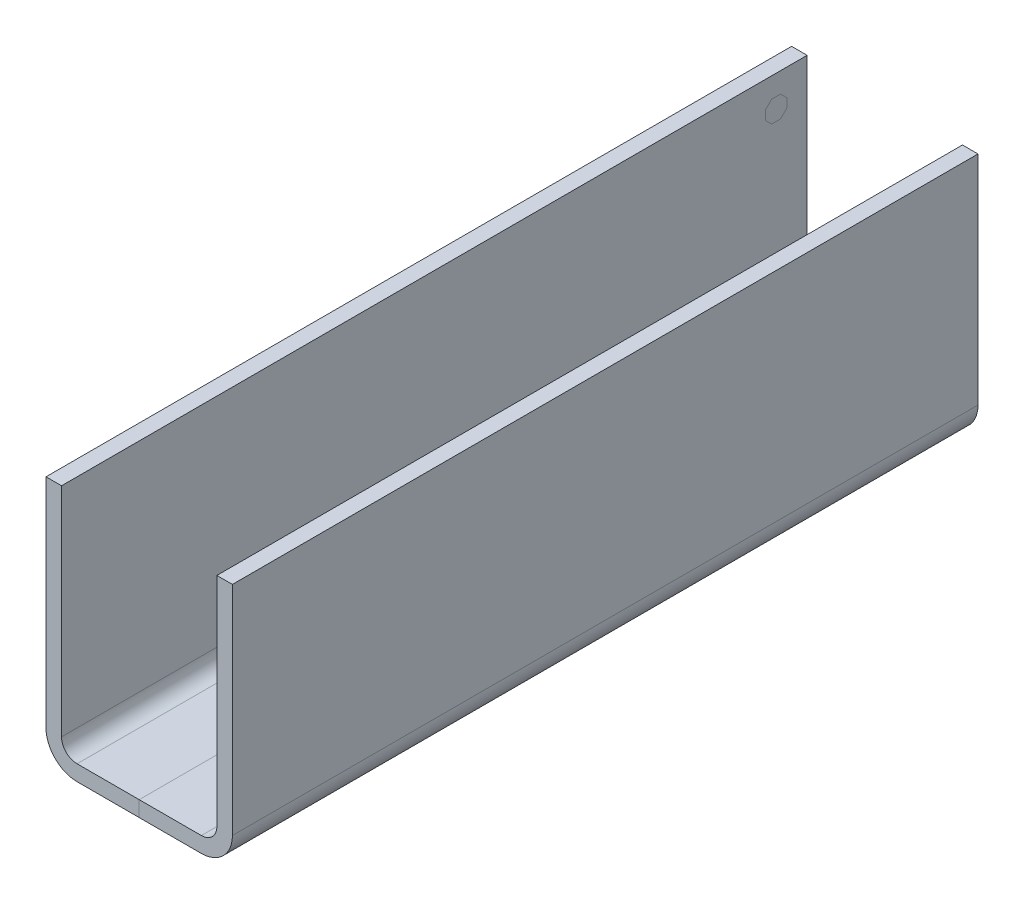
from build123d import *

# Parameters (mm, degrees)
EXTRUDE_THIN1_DEPTH    = 304.8
SPLIT1_SURFACE_1_BACK  = 661.4
SPLIT1_SURFACE_1_DEPTH = 1322.8
SPLIT1_SURFACE_2_BACK  = 661.4
SPLIT1_SURFACE_2_DEPTH = 1322.8


with BuildPart() as part:
    # Sketch1 → Extrude-Thin1 (new, symmetric)
    with BuildSketch(Plane.XY):
        with BuildLine():
            Line((-76.2, 203.2), (-76.2, 25.4))
            ThreePointArc((-76.2, 25.4), (-68.760512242, 7.439487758), (-50.8, 0))
            Line((-50.8, 0), (50.8, 0))
            ThreePointArc((50.8, 0), (68.760512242, 7.439487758), (76.2, 25.4))
            Line((76.2, 25.4), (76.2, 203.2))
            Line((76.2, 203.2), (63.5, 203.2))
            Line((63.5, 203.2), (63.5, 25.4))
            ThreePointArc((63.5, 25.4), (59.780256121, 16.419743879), (50.8, 12.7))
            Line((50.8, 12.7), (-50.8, 12.7))
            ThreePointArc((-50.8, 12.7), (-59.780256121, 16.419743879), (-63.5, 25.4))
            Line((-63.5, 25.4), (-63.5, 203.2))
            Line((-63.5, 203.2), (-76.2, 203.2))
        make_face()
    extrude(amount=EXTRUDE_THIN1_DEPTH, both=True)


with BuildPart() as body_2:
    # Split1: the piece behind the surface
    add(part.part)
    # Split1 surface: a surface, the sketch's curves swept straight by 1322.8 mm
    with BuildLine(Plane(origin=(0, 12.7, 0), x_dir=(1, 0, 0), z_dir=(0, 1, 0)).offset(-SPLIT1_SURFACE_1_BACK), mode=Mode.PRIVATE) as split1_surface_1_path:
        Line((0, -304.8), (0, 304.8))
    split1_surface_1 = Shell.extrude(split1_surface_1_path.wire(), (0 * SPLIT1_SURFACE_1_DEPTH, 1 * SPLIT1_SURFACE_1_DEPTH, 0 * SPLIT1_SURFACE_1_DEPTH))
    split(bisect_by=split1_surface_1, keep=Keep.BOTTOM)


with BuildPart() as part_1:
    add(part.part)

    # Split1: split by a surface, the side it looks to stays
    # Split1 surface: a surface, the sketch's curves swept straight by 1322.8 mm
    with BuildLine(Plane(origin=(0, 12.7, 0), x_dir=(1, 0, 0), z_dir=(0, 1, 0)).offset(-SPLIT1_SURFACE_2_BACK), mode=Mode.PRIVATE) as split1_surface_2_path:
        Line((0, -304.8), (0, 304.8))
    split1_surface_2 = Shell.extrude(split1_surface_2_path.wire(), (0 * SPLIT1_SURFACE_2_DEPTH, 1 * SPLIT1_SURFACE_2_DEPTH, 0 * SPLIT1_SURFACE_2_DEPTH))
    split(bisect_by=split1_surface_2, keep=Keep.TOP)


solid = Compound([body_2.part, part_1.part])
